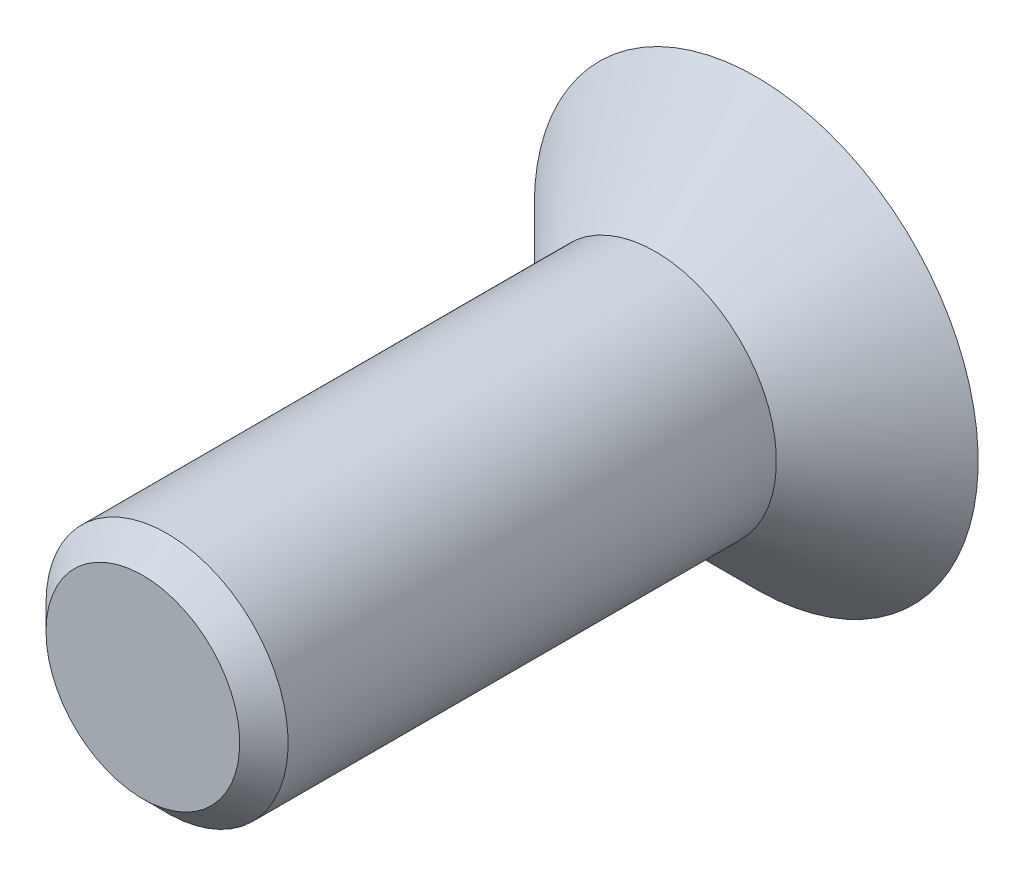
ISO-10303-21;
HEADER;
FILE_DESCRIPTION(('STEP AP214'),'2;1');
FILE_NAME('part.step','',(''),(''),'','','');
FILE_SCHEMA(('AUTOMOTIVE_DESIGN { 1 0 10303 214 1 1 1 1 }'));
ENDSEC;
DATA;
#1=APPLICATION_CONTEXT('core data for automotive mechanical design processes');
#2=APPLICATION_PROTOCOL_DEFINITION('international standard','automotive_design',2000,#1);
#3=PRODUCT_CONTEXT('',#1,'mechanical');
#4=PRODUCT('Part','Part','',(#3));
#5=PRODUCT_RELATED_PRODUCT_CATEGORY('part','',(#4));
#6=PRODUCT_DEFINITION_FORMATION('','',#4);
#7=PRODUCT_DEFINITION_CONTEXT('part definition',#1,'design');
#8=PRODUCT_DEFINITION('design','',#6,#7);
#9=PRODUCT_DEFINITION_SHAPE('','',#8);
#10=(LENGTH_UNIT() NAMED_UNIT(*) SI_UNIT(.MILLI.,.METRE.));
#11=(NAMED_UNIT(*) PLANE_ANGLE_UNIT() SI_UNIT($,.RADIAN.));
#12=(NAMED_UNIT(*) SI_UNIT($,.STERADIAN.) SOLID_ANGLE_UNIT());
#13=UNCERTAINTY_MEASURE_WITH_UNIT(LENGTH_MEASURE(1.E-05),#10,'distance_accuracy_value','');
#14=(GEOMETRIC_REPRESENTATION_CONTEXT(3) GLOBAL_UNCERTAINTY_ASSIGNED_CONTEXT((#13)) GLOBAL_UNIT_ASSIGNED_CONTEXT((#10,
#11,#12)) REPRESENTATION_CONTEXT('',''));
#15=CARTESIAN_POINT('',(0.,0.,0.));
#16=DIRECTION('',(0.,0.,1.));
#17=DIRECTION('',(1.,0.,0.));
#18=AXIS2_PLACEMENT_3D('',#15,#16,#17);
#19=CARTESIAN_POINT('',(0.,0.,-1.25));
#20=DIRECTION('',(0.,0.,1.));
#21=DIRECTION('',(0.999999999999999,0.,0.));
#22=AXIS2_PLACEMENT_3D('',#19,#20,#21);
#23=PLANE('',#22);
#24=CARTESIAN_POINT('',(0.,0.,-1.25));
#25=DIRECTION('',(0.,0.,-1.));
#26=DIRECTION('',(-0.999999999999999,0.,0.));
#27=AXIS2_PLACEMENT_3D('',#24,#25,#26);
#28=CIRCLE('',#27,2.75);
#29=CARTESIAN_POINT('',(-2.75000000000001,0.,-1.25));
#30=VERTEX_POINT('',#29);
#31=EDGE_CURVE('E85',#30,#30,#28,.T.);
#32=ORIENTED_EDGE('',*,*,#31,.T.);
#33=EDGE_LOOP('',(#32));
#34=FACE_BOUND('',#33,.T.);
#35=DIRECTION('',(-0.866025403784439,0.499999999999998,0.));
#36=VECTOR('',#35,1.);
#37=CARTESIAN_POINT('',(0.,1.15470053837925,-1.25));
#38=LINE('',#37,#36);
#39=CARTESIAN_POINT('',(1.,0.577350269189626,-1.25));
#40=VERTEX_POINT('',#39);
#41=CARTESIAN_POINT('',(0.,1.15470053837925,-1.25));
#42=VERTEX_POINT('',#41);
#43=EDGE_CURVE('E42',#40,#42,#38,.T.);
#44=ORIENTED_EDGE('',*,*,#43,.T.);
#45=DIRECTION('',(-0.866025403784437,-0.500000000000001,0.));
#46=VECTOR('',#45,1.);
#47=CARTESIAN_POINT('',(-1.,0.577350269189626,-1.25));
#48=LINE('',#47,#46);
#49=CARTESIAN_POINT('',(-1.,0.577350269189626,-1.25));
#50=VERTEX_POINT('',#49);
#51=EDGE_CURVE('E142',#42,#50,#48,.T.);
#52=ORIENTED_EDGE('',*,*,#51,.T.);
#53=DIRECTION('',(0.,-0.999999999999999,0.));
#54=VECTOR('',#53,1.);
#55=CARTESIAN_POINT('',(-1.,-0.57735026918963,-1.25));
#56=LINE('',#55,#54);
#57=CARTESIAN_POINT('',(-1.,-0.57735026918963,-1.25));
#58=VERTEX_POINT('',#57);
#59=EDGE_CURVE('E145',#50,#58,#56,.T.);
#60=ORIENTED_EDGE('',*,*,#59,.T.);
#61=DIRECTION('',(0.866025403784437,-0.500000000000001,0.));
#62=VECTOR('',#61,1.);
#63=CARTESIAN_POINT('',(-1.,-0.57735026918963,-1.25));
#64=LINE('',#63,#62);
#65=CARTESIAN_POINT('',(0.,-1.15470053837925,-1.25));
#66=VERTEX_POINT('',#65);
#67=EDGE_CURVE('E151',#58,#66,#64,.T.);
#68=ORIENTED_EDGE('',*,*,#67,.T.);
#69=DIRECTION('',(0.866025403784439,0.499999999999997,0.));
#70=VECTOR('',#69,1.);
#71=CARTESIAN_POINT('',(0.,-1.15470053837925,-1.25));
#72=LINE('',#71,#70);
#73=CARTESIAN_POINT('',(1.,-0.57735026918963,-1.25));
#74=VERTEX_POINT('',#73);
#75=EDGE_CURVE('E154',#66,#74,#72,.T.);
#76=ORIENTED_EDGE('',*,*,#75,.T.);
#77=DIRECTION('',(0.,0.999999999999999,0.));
#78=VECTOR('',#77,1.);
#79=CARTESIAN_POINT('',(1.,-0.57735026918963,-1.25));
#80=LINE('',#79,#78);
#81=EDGE_CURVE('E91',#74,#40,#80,.T.);
#82=ORIENTED_EDGE('',*,*,#81,.T.);
#83=EDGE_LOOP('',(#44,#52,#60,#68,#76,#82));
#84=FACE_BOUND('',#83,.T.);
#85=ADVANCED_FACE('F28',(#34,#84),#23,.F.);
#86=CARTESIAN_POINT('',(0.,0.,0.));
#87=DIRECTION('',(0.,0.,-1.));
#88=DIRECTION('',(-0.999999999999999,0.,0.));
#89=AXIS2_PLACEMENT_3D('',#86,#87,#88);
#90=CONICAL_SURFACE('',#89,1.5,0.78539816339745);
#91=CARTESIAN_POINT('',(0.,0.,0.));
#92=DIRECTION('',(0.,0.,1.));
#93=DIRECTION('',(0.999999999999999,0.,0.));
#94=AXIS2_PLACEMENT_3D('',#91,#92,#93);
#95=CIRCLE('',#94,1.5);
#96=CARTESIAN_POINT('',(-1.5,0.,0.));
#97=VERTEX_POINT('',#96);
#98=EDGE_CURVE('E143',#97,#97,#95,.T.);
#99=CARTESIAN_POINT('',(-2.75000000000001,0.,-1.25));
#100=CARTESIAN_POINT('',(-2.73697916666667,0.,-1.23697916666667));
#101=CARTESIAN_POINT('',(-2.72395833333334,0.,-1.22395833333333));
#102=CARTESIAN_POINT('',(-2.69791666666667,0.,-1.19791666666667));
#103=CARTESIAN_POINT('',(-2.68489583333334,0.,-1.18489583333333));
#104=CARTESIAN_POINT('',(-2.65885416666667,0.,-1.15885416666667));
#105=CARTESIAN_POINT('',(-2.64583333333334,0.,-1.14583333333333));
#106=CARTESIAN_POINT('',(-2.61979166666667,0.,-1.11979166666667));
#107=CARTESIAN_POINT('',(-2.60677083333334,0.,-1.10677083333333));
#108=CARTESIAN_POINT('',(-2.58072916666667,0.,-1.08072916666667));
#109=CARTESIAN_POINT('',(-2.56770833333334,0.,-1.06770833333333));
#110=CARTESIAN_POINT('',(-2.54166666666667,0.,-1.04166666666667));
#111=CARTESIAN_POINT('',(-2.52864583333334,0.,-1.02864583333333));
#112=CARTESIAN_POINT('',(-2.50260416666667,0.,-1.00260416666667));
#113=CARTESIAN_POINT('',(-2.48958333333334,0.,-0.989583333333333));
#114=CARTESIAN_POINT('',(-2.46354166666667,0.,-0.963541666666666));
#115=CARTESIAN_POINT('',(-2.45052083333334,0.,-0.950520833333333));
#116=CARTESIAN_POINT('',(-2.42447916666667,0.,-0.924479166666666));
#117=CARTESIAN_POINT('',(-2.41145833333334,0.,-0.911458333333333));
#118=CARTESIAN_POINT('',(-2.38541666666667,0.,-0.885416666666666));
#119=CARTESIAN_POINT('',(-2.37239583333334,0.,-0.872395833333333));
#120=CARTESIAN_POINT('',(-2.34635416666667,0.,-0.846354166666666));
#121=CARTESIAN_POINT('',(-2.33333333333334,0.,-0.833333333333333));
#122=CARTESIAN_POINT('',(-2.30729166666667,0.,-0.807291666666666));
#123=CARTESIAN_POINT('',(-2.29427083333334,0.,-0.794270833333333));
#124=CARTESIAN_POINT('',(-2.26822916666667,0.,-0.768229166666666));
#125=CARTESIAN_POINT('',(-2.25520833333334,0.,-0.755208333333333));
#126=CARTESIAN_POINT('',(-2.22916666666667,0.,-0.729166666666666));
#127=CARTESIAN_POINT('',(-2.21614583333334,0.,-0.716145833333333));
#128=CARTESIAN_POINT('',(-2.19010416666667,0.,-0.690104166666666));
#129=CARTESIAN_POINT('',(-2.17708333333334,0.,-0.677083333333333));
#130=CARTESIAN_POINT('',(-2.15104166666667,0.,-0.651041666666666));
#131=CARTESIAN_POINT('',(-2.13802083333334,0.,-0.638020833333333));
#132=CARTESIAN_POINT('',(-2.11197916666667,0.,-0.611979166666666));
#133=CARTESIAN_POINT('',(-2.09895833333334,0.,-0.598958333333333));
#134=CARTESIAN_POINT('',(-2.07291666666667,0.,-0.572916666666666));
#135=CARTESIAN_POINT('',(-2.05989583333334,0.,-0.559895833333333));
#136=CARTESIAN_POINT('',(-2.03385416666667,0.,-0.533854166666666));
#137=CARTESIAN_POINT('',(-2.02083333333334,0.,-0.520833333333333));
#138=CARTESIAN_POINT('',(-1.99479166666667,0.,-0.494791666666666));
#139=CARTESIAN_POINT('',(-1.98177083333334,0.,-0.481770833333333));
#140=CARTESIAN_POINT('',(-1.95572916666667,0.,-0.455729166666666));
#141=CARTESIAN_POINT('',(-1.94270833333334,0.,-0.442708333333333));
#142=CARTESIAN_POINT('',(-1.91666666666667,0.,-0.416666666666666));
#143=CARTESIAN_POINT('',(-1.90364583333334,0.,-0.403645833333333));
#144=CARTESIAN_POINT('',(-1.87760416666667,0.,-0.377604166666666));
#145=CARTESIAN_POINT('',(-1.86458333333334,0.,-0.364583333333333));
#146=CARTESIAN_POINT('',(-1.83854166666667,0.,-0.338541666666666));
#147=CARTESIAN_POINT('',(-1.82552083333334,0.,-0.325520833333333));
#148=CARTESIAN_POINT('',(-1.79947916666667,0.,-0.299479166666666));
#149=CARTESIAN_POINT('',(-1.78645833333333,0.,-0.286458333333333));
#150=CARTESIAN_POINT('',(-1.76041666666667,0.,-0.260416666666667));
#151=CARTESIAN_POINT('',(-1.74739583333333,0.,-0.247395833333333));
#152=CARTESIAN_POINT('',(-1.72135416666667,0.,-0.221354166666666));
#153=CARTESIAN_POINT('',(-1.70833333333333,0.,-0.208333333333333));
#154=CARTESIAN_POINT('',(-1.68229166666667,0.,-0.182291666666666));
#155=CARTESIAN_POINT('',(-1.66927083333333,0.,-0.169270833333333));
#156=CARTESIAN_POINT('',(-1.64322916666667,0.,-0.143229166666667));
#157=CARTESIAN_POINT('',(-1.63020833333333,0.,-0.130208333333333));
#158=CARTESIAN_POINT('',(-1.60416666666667,0.,-0.104166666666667));
#159=CARTESIAN_POINT('',(-1.59114583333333,0.,-0.0911458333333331));
#160=CARTESIAN_POINT('',(-1.56510416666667,0.,-0.0651041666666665));
#161=CARTESIAN_POINT('',(-1.55208333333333,0.,-0.0520833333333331));
#162=CARTESIAN_POINT('',(-1.52604166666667,0.,-0.0260416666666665));
#163=CARTESIAN_POINT('',(-1.51302083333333,0.,-0.0130208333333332));
#164=CARTESIAN_POINT('',(-1.5,0.,0.));
#165=B_SPLINE_CURVE_WITH_KNOTS('',3,(#99,#100,#101,#102,#103,#104,#105,#106,#107,#108,#109,#110,
#111,#112,#113,#114,#115,#116,#117,#118,#119,#120,#121,#122,#123,#124,#125,#126,#127,#128,#129,
#130,#131,#132,#133,#134,#135,#136,#137,#138,#139,#140,#141,#142,#143,#144,#145,#146,#147,#148,
#149,#150,#151,#152,#153,#154,#155,#156,#157,#158,#159,#160,#161,#162,#163,#164),.UNSPECIFIED.,
.F.,.F.,(4,2,2,2,2,2,2,2,2,2,2,2,2,2,2,2,2,2,2,2,2,2,2,2,2,2,2,2,2,2,2,2,4),(0.,
0.0552427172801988,0.110485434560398,0.165728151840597,0.220970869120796,0.276213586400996,
0.331456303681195,0.386699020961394,0.441941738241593,0.497184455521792,0.552427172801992,
0.607669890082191,0.66291260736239,0.718155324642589,0.773398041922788,0.828640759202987,
0.883883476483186,0.939126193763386,0.994368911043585,1.04961162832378,1.10485434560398,
1.16009706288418,1.21533978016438,1.27058249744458,1.32582521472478,1.38106793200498,
1.43631064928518,1.49155336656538,1.54679608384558,1.60203880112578,1.65728151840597,
1.71252423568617,1.76776695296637),.UNSPECIFIED.);
#166=EDGE_CURVE('BSEAM129',#30,#97,#165,.T.);
#167=ORIENTED_EDGE('',*,*,#31,.F.);
#168=ORIENTED_EDGE('',*,*,#98,.F.);
#169=ORIENTED_EDGE('',*,*,#166,.T.);
#170=ORIENTED_EDGE('',*,*,#166,.F.);
#171=EDGE_LOOP('',(#167,#169,#168,#170));
#172=FACE_BOUND('',#171,.T.);
#173=ADVANCED_FACE('F129',(#172),#90,.T.);
#174=CARTESIAN_POINT('',(0.,1.15470053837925,0.0499999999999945));
#175=DIRECTION('',(-0.499999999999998,-0.866025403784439,0.));
#176=DIRECTION('',(0.866025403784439,-0.499999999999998,0.));
#177=AXIS2_PLACEMENT_3D('',#174,#175,#176);
#178=PLANE('',#177);
#179=DIRECTION('',(-0.866025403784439,0.499999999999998,0.));
#180=VECTOR('',#179,1.);
#181=CARTESIAN_POINT('',(0.5,0.866025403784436,0.));
#182=LINE('',#181,#180);
#183=CARTESIAN_POINT('',(1.,0.577350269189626,0.));
#184=VERTEX_POINT('',#183);
#185=CARTESIAN_POINT('',(0.,1.15470053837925,0.));
#186=VERTEX_POINT('',#185);
#187=EDGE_CURVE('E50',#184,#186,#182,.T.);
#188=ORIENTED_EDGE('',*,*,#187,.T.);
#189=DIRECTION('',(0.,0.,-1.));
#190=VECTOR('',#189,1.);
#191=CARTESIAN_POINT('',(0.,1.15470053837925,0.0499999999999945));
#192=LINE('',#191,#190);
#193=EDGE_CURVE('E163',#186,#42,#192,.T.);
#194=ORIENTED_EDGE('',*,*,#193,.T.);
#195=ORIENTED_EDGE('',*,*,#43,.F.);
#196=DIRECTION('',(0.,0.,-1.));
#197=VECTOR('',#196,1.);
#198=CARTESIAN_POINT('',(1.,0.577350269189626,0.0499999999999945));
#199=LINE('',#198,#197);
#200=EDGE_CURVE('E96',#184,#40,#199,.T.);
#201=ORIENTED_EDGE('',*,*,#200,.F.);
#202=EDGE_LOOP('',(#188,#194,#195,#201));
#203=FACE_BOUND('',#202,.T.);
#204=ADVANCED_FACE('F134',(#203),#178,.T.);
#205=CARTESIAN_POINT('',(-1.,0.577350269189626,0.0499999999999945));
#206=DIRECTION('',(0.500000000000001,-0.866025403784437,0.));
#207=DIRECTION('',(0.866025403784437,0.500000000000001,0.));
#208=AXIS2_PLACEMENT_3D('',#205,#206,#207);
#209=PLANE('',#208);
#210=DIRECTION('',(-0.866025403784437,-0.500000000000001,0.));
#211=VECTOR('',#210,1.);
#212=CARTESIAN_POINT('',(-0.5,0.866025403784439,0.));
#213=LINE('',#212,#211);
#214=CARTESIAN_POINT('',(-1.,0.577350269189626,0.));
#215=VERTEX_POINT('',#214);
#216=EDGE_CURVE('E108',#186,#215,#213,.T.);
#217=ORIENTED_EDGE('',*,*,#216,.T.);
#218=DIRECTION('',(0.,0.,-1.));
#219=VECTOR('',#218,1.);
#220=CARTESIAN_POINT('',(-1.,0.577350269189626,0.0499999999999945));
#221=LINE('',#220,#219);
#222=EDGE_CURVE('E161',#215,#50,#221,.T.);
#223=ORIENTED_EDGE('',*,*,#222,.T.);
#224=ORIENTED_EDGE('',*,*,#51,.F.);
#225=ORIENTED_EDGE('',*,*,#193,.F.);
#226=EDGE_LOOP('',(#217,#223,#224,#225));
#227=FACE_BOUND('',#226,.T.);
#228=ADVANCED_FACE('F166',(#227),#209,.T.);
#229=CARTESIAN_POINT('',(-1.,-0.57735026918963,0.0499999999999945));
#230=DIRECTION('',(0.999999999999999,0.,0.));
#231=DIRECTION('',(0.,0.,-1.));
#232=AXIS2_PLACEMENT_3D('',#229,#230,#231);
#233=PLANE('',#232);
#234=DIRECTION('',(0.,-0.999999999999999,0.));
#235=VECTOR('',#234,1.);
#236=CARTESIAN_POINT('',(-1.,0.,0.));
#237=LINE('',#236,#235);
#238=CARTESIAN_POINT('',(-1.,-0.57735026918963,0.));
#239=VERTEX_POINT('',#238);
#240=EDGE_CURVE('E102',#215,#239,#237,.T.);
#241=ORIENTED_EDGE('',*,*,#240,.T.);
#242=DIRECTION('',(0.,0.,-1.));
#243=VECTOR('',#242,1.);
#244=CARTESIAN_POINT('',(-1.,-0.57735026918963,0.0499999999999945));
#245=LINE('',#244,#243);
#246=EDGE_CURVE('E159',#239,#58,#245,.T.);
#247=ORIENTED_EDGE('',*,*,#246,.T.);
#248=ORIENTED_EDGE('',*,*,#59,.F.);
#249=ORIENTED_EDGE('',*,*,#222,.F.);
#250=EDGE_LOOP('',(#241,#247,#248,#249));
#251=FACE_BOUND('',#250,.T.);
#252=ADVANCED_FACE('F170',(#251),#233,.T.);
#253=CARTESIAN_POINT('',(-1.,-0.57735026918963,0.0499999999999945));
#254=DIRECTION('',(0.500000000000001,0.866025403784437,0.));
#255=DIRECTION('',(-0.866025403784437,0.500000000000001,0.));
#256=AXIS2_PLACEMENT_3D('',#253,#254,#255);
#257=PLANE('',#256);
#258=DIRECTION('',(0.866025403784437,-0.500000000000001,0.));
#259=VECTOR('',#258,1.);
#260=CARTESIAN_POINT('',(-0.500000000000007,-0.866025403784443,0.));
#261=LINE('',#260,#259);
#262=CARTESIAN_POINT('',(0.,-1.15470053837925,0.));
#263=VERTEX_POINT('',#262);
#264=EDGE_CURVE('E100',#239,#263,#261,.T.);
#265=ORIENTED_EDGE('',*,*,#264,.T.);
#266=DIRECTION('',(0.,0.,-1.));
#267=VECTOR('',#266,1.);
#268=CARTESIAN_POINT('',(0.,-1.15470053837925,0.0499999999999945));
#269=LINE('',#268,#267);
#270=EDGE_CURVE('E95',#263,#66,#269,.T.);
#271=ORIENTED_EDGE('',*,*,#270,.T.);
#272=ORIENTED_EDGE('',*,*,#67,.F.);
#273=ORIENTED_EDGE('',*,*,#246,.F.);
#274=EDGE_LOOP('',(#265,#271,#272,#273));
#275=FACE_BOUND('',#274,.T.);
#276=ADVANCED_FACE('F174',(#275),#257,.T.);
#277=CARTESIAN_POINT('',(0.,-1.15470053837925,0.0499999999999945));
#278=DIRECTION('',(-0.499999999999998,0.86602540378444,0.));
#279=DIRECTION('',(-0.86602540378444,-0.499999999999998,0.));
#280=AXIS2_PLACEMENT_3D('',#277,#278,#279);
#281=PLANE('',#280);
#282=DIRECTION('',(0.86602540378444,0.499999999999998,0.));
#283=VECTOR('',#282,1.);
#284=CARTESIAN_POINT('',(0.5,-0.866025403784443,0.));
#285=LINE('',#284,#283);
#286=CARTESIAN_POINT('',(1.,-0.57735026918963,0.));
#287=VERTEX_POINT('',#286);
#288=EDGE_CURVE('E82',#263,#287,#285,.T.);
#289=ORIENTED_EDGE('',*,*,#288,.T.);
#290=DIRECTION('',(0.,0.,-1.));
#291=VECTOR('',#290,1.);
#292=CARTESIAN_POINT('',(1.,-0.57735026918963,0.0499999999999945));
#293=LINE('',#292,#291);
#294=EDGE_CURVE('E88',#287,#74,#293,.T.);
#295=ORIENTED_EDGE('',*,*,#294,.T.);
#296=ORIENTED_EDGE('',*,*,#75,.F.);
#297=ORIENTED_EDGE('',*,*,#270,.F.);
#298=EDGE_LOOP('',(#289,#295,#296,#297));
#299=FACE_BOUND('',#298,.T.);
#300=ADVANCED_FACE('F99',(#299),#281,.T.);
#301=CARTESIAN_POINT('',(1.,-0.57735026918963,0.0499999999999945));
#302=DIRECTION('',(-0.999999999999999,0.,0.));
#303=DIRECTION('',(0.,0.,1.));
#304=AXIS2_PLACEMENT_3D('',#301,#302,#303);
#305=PLANE('',#304);
#306=DIRECTION('',(0.,0.999999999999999,0.));
#307=VECTOR('',#306,1.);
#308=CARTESIAN_POINT('',(1.,0.,0.));
#309=LINE('',#308,#307);
#310=EDGE_CURVE('E78',#287,#184,#309,.T.);
#311=ORIENTED_EDGE('',*,*,#310,.T.);
#312=ORIENTED_EDGE('',*,*,#200,.T.);
#313=ORIENTED_EDGE('',*,*,#81,.F.);
#314=ORIENTED_EDGE('',*,*,#294,.F.);
#315=EDGE_LOOP('',(#311,#312,#313,#314));
#316=FACE_BOUND('',#315,.T.);
#317=ADVANCED_FACE('F89',(#316),#305,.T.);
#318=CARTESIAN_POINT('',(0.,0.,0.));
#319=DIRECTION('',(0.,0.,-1.));
#320=DIRECTION('',(-0.999999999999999,0.,0.));
#321=AXIS2_PLACEMENT_3D('',#318,#319,#320);
#322=PLANE('',#321);
#323=ORIENTED_EDGE('',*,*,#216,.F.);
#324=ORIENTED_EDGE('',*,*,#187,.F.);
#325=ORIENTED_EDGE('',*,*,#310,.F.);
#326=ORIENTED_EDGE('',*,*,#288,.F.);
#327=ORIENTED_EDGE('',*,*,#264,.F.);
#328=ORIENTED_EDGE('',*,*,#240,.F.);
#329=EDGE_LOOP('',(#323,#324,#325,#326,#327,#328));
#330=FACE_BOUND('',#329,.T.);
#331=ADVANCED_FACE('F80',(#330),#322,.T.);
#332=CARTESIAN_POINT('',(0.,0.,6.34999999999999));
#333=DIRECTION('',(0.,0.,1.));
#334=DIRECTION('',(0.999999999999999,0.,0.));
#335=AXIS2_PLACEMENT_3D('',#332,#333,#334);
#336=PLANE('',#335);
#337=CARTESIAN_POINT('',(0.,0.,6.34999999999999));
#338=DIRECTION('',(0.,0.,1.));
#339=DIRECTION('',(0.999999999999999,0.,0.));
#340=AXIS2_PLACEMENT_3D('',#337,#338,#339);
#341=CIRCLE('',#340,1.2);
#342=CARTESIAN_POINT('',(-1.2,0.,6.34999999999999));
#343=VERTEX_POINT('',#342);
#344=EDGE_CURVE('E35',#343,#343,#341,.T.);
#345=ORIENTED_EDGE('',*,*,#344,.T.);
#346=EDGE_LOOP('',(#345));
#347=FACE_BOUND('',#346,.T.);
#348=ADVANCED_FACE('F114',(#347),#336,.T.);
#349=CARTESIAN_POINT('',(0.,0.,0.));
#350=DIRECTION('',(0.,0.,1.));
#351=DIRECTION('',(0.999999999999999,0.,0.));
#352=AXIS2_PLACEMENT_3D('',#349,#350,#351);
#353=CYLINDRICAL_SURFACE('',#352,1.5);
#354=CARTESIAN_POINT('',(0.,0.,6.05));
#355=DIRECTION('',(0.,0.,1.));
#356=DIRECTION('',(0.999999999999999,0.,0.));
#357=AXIS2_PLACEMENT_3D('',#354,#355,#356);
#358=CIRCLE('',#357,1.5);
#359=CARTESIAN_POINT('',(-1.49999999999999,0.,6.05));
#360=VERTEX_POINT('',#359);
#361=EDGE_CURVE('E11',#360,#360,#358,.F.);
#362=ORIENTED_EDGE('',*,*,#361,.T.);
#363=EDGE_LOOP('',(#362));
#364=FACE_BOUND('',#363,.T.);
#365=ORIENTED_EDGE('',*,*,#98,.T.);
#366=EDGE_LOOP('',(#365));
#367=FACE_BOUND('',#366,.T.);
#368=ADVANCED_FACE('F118',(#364,#367),#353,.T.);
#369=CARTESIAN_POINT('',(0.,0.,6.34999999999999));
#370=DIRECTION('',(0.,0.,-1.));
#371=DIRECTION('',(-0.999999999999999,0.,0.));
#372=AXIS2_PLACEMENT_3D('',#369,#370,#371);
#373=CONICAL_SURFACE('',#372,1.2,0.785398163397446);
#374=CARTESIAN_POINT('',(-1.49999999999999,0.,6.05));
#375=CARTESIAN_POINT('',(-1.49687499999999,0.,6.053125));
#376=CARTESIAN_POINT('',(-1.49374999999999,0.,6.05625));
#377=CARTESIAN_POINT('',(-1.48749999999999,0.,6.0625));
#378=CARTESIAN_POINT('',(-1.48437499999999,0.,6.065625));
#379=CARTESIAN_POINT('',(-1.47812499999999,0.,6.071875));
#380=CARTESIAN_POINT('',(-1.47499999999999,0.,6.075));
#381=CARTESIAN_POINT('',(-1.46874999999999,0.,6.08125));
#382=CARTESIAN_POINT('',(-1.46562499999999,0.,6.084375));
#383=CARTESIAN_POINT('',(-1.45937499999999,0.,6.090625));
#384=CARTESIAN_POINT('',(-1.45624999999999,0.,6.09375));
#385=CARTESIAN_POINT('',(-1.44999999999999,0.,6.1));
#386=CARTESIAN_POINT('',(-1.44687499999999,0.,6.103125));
#387=CARTESIAN_POINT('',(-1.44062499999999,0.,6.109375));
#388=CARTESIAN_POINT('',(-1.43749999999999,0.,6.1125));
#389=CARTESIAN_POINT('',(-1.43124999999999,0.,6.11875));
#390=CARTESIAN_POINT('',(-1.42812499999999,0.,6.121875));
#391=CARTESIAN_POINT('',(-1.42187499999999,0.,6.128125));
#392=CARTESIAN_POINT('',(-1.41874999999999,0.,6.13125));
#393=CARTESIAN_POINT('',(-1.41249999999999,0.,6.1375));
#394=CARTESIAN_POINT('',(-1.40937499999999,0.,6.140625));
#395=CARTESIAN_POINT('',(-1.40312499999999,0.,6.146875));
#396=CARTESIAN_POINT('',(-1.4,0.,6.15));
#397=CARTESIAN_POINT('',(-1.39374999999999,0.,6.15625));
#398=CARTESIAN_POINT('',(-1.39062499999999,0.,6.159375));
#399=CARTESIAN_POINT('',(-1.384375,0.,6.165625));
#400=CARTESIAN_POINT('',(-1.38125,0.,6.16875));
#401=CARTESIAN_POINT('',(-1.375,0.,6.175));
#402=CARTESIAN_POINT('',(-1.371875,0.,6.178125));
#403=CARTESIAN_POINT('',(-1.365625,0.,6.184375));
#404=CARTESIAN_POINT('',(-1.3625,0.,6.1875));
#405=CARTESIAN_POINT('',(-1.35625,0.,6.19375));
#406=CARTESIAN_POINT('',(-1.353125,0.,6.196875));
#407=CARTESIAN_POINT('',(-1.346875,0.,6.203125));
#408=CARTESIAN_POINT('',(-1.34375,0.,6.20625));
#409=CARTESIAN_POINT('',(-1.3375,0.,6.2125));
#410=CARTESIAN_POINT('',(-1.334375,0.,6.215625));
#411=CARTESIAN_POINT('',(-1.328125,0.,6.221875));
#412=CARTESIAN_POINT('',(-1.325,0.,6.225));
#413=CARTESIAN_POINT('',(-1.31875,0.,6.23125));
#414=CARTESIAN_POINT('',(-1.315625,0.,6.234375));
#415=CARTESIAN_POINT('',(-1.309375,0.,6.240625));
#416=CARTESIAN_POINT('',(-1.30625,0.,6.24375));
#417=CARTESIAN_POINT('',(-1.3,0.,6.25));
#418=CARTESIAN_POINT('',(-1.296875,0.,6.253125));
#419=CARTESIAN_POINT('',(-1.290625,0.,6.259375));
#420=CARTESIAN_POINT('',(-1.2875,0.,6.2625));
#421=CARTESIAN_POINT('',(-1.28125,0.,6.26875));
#422=CARTESIAN_POINT('',(-1.278125,0.,6.271875));
#423=CARTESIAN_POINT('',(-1.271875,0.,6.278125));
#424=CARTESIAN_POINT('',(-1.26875,0.,6.28125));
#425=CARTESIAN_POINT('',(-1.2625,0.,6.2875));
#426=CARTESIAN_POINT('',(-1.259375,0.,6.290625));
#427=CARTESIAN_POINT('',(-1.253125,0.,6.296875));
#428=CARTESIAN_POINT('',(-1.25,0.,6.3));
#429=CARTESIAN_POINT('',(-1.24375,0.,6.30625));
#430=CARTESIAN_POINT('',(-1.240625,0.,6.309375));
#431=CARTESIAN_POINT('',(-1.234375,0.,6.315625));
#432=CARTESIAN_POINT('',(-1.23125,0.,6.31875));
#433=CARTESIAN_POINT('',(-1.225,0.,6.325));
#434=CARTESIAN_POINT('',(-1.221875,0.,6.328125));
#435=CARTESIAN_POINT('',(-1.215625,0.,6.334375));
#436=CARTESIAN_POINT('',(-1.2125,0.,6.3375));
#437=CARTESIAN_POINT('',(-1.20625,0.,6.34375));
#438=CARTESIAN_POINT('',(-1.203125,0.,6.34687499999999));
#439=CARTESIAN_POINT('',(-1.2,0.,6.34999999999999));
#440=B_SPLINE_CURVE_WITH_KNOTS('',3,(#374,#375,#376,#377,#378,#379,#380,#381,#382,#383,#384,
#385,#386,#387,#388,#389,#390,#391,#392,#393,#394,#395,#396,#397,#398,#399,#400,#401,#402,#403,
#404,#405,#406,#407,#408,#409,#410,#411,#412,#413,#414,#415,#416,#417,#418,#419,#420,#421,#422,
#423,#424,#425,#426,#427,#428,#429,#430,#431,#432,#433,#434,#435,#436,#437,#438,#439),
.UNSPECIFIED.,.F.,.F.,(4,2,2,2,2,2,2,2,2,2,2,2,2,2,2,2,2,2,2,2,2,2,2,2,2,2,2,2,2,2,2,2,4),(0.,
0.013258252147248,0.0265165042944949,0.0397747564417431,0.05303300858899,0.0662912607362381,
0.079549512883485,0.092807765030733,0.10606601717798,0.119324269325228,0.132582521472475,
0.145840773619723,0.15909902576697,0.172357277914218,0.185615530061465,0.198873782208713,
0.21213203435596,0.225390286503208,0.238648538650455,0.251906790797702,0.26516504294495,
0.278423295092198,0.291681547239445,0.304939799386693,0.31819805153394,0.331456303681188,
0.344714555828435,0.357972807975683,0.371231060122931,0.384489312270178,0.397747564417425,
0.411005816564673,0.42426406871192),.UNSPECIFIED.);
#441=EDGE_CURVE('BSEAM116',#360,#343,#440,.T.);
#442=ORIENTED_EDGE('',*,*,#361,.F.);
#443=ORIENTED_EDGE('',*,*,#344,.F.);
#444=ORIENTED_EDGE('',*,*,#441,.T.);
#445=ORIENTED_EDGE('',*,*,#441,.F.);
#446=EDGE_LOOP('',(#442,#444,#443,#445));
#447=FACE_BOUND('',#446,.T.);
#448=ADVANCED_FACE('F116',(#447),#373,.T.);
#449=CLOSED_SHELL('',(#85,#173,#204,#228,#252,#276,#300,#317,#331,#348,#368,#448));
#450=MANIFOLD_SOLID_BREP('B2',#449);
#451=ADVANCED_BREP_SHAPE_REPRESENTATION('',(#18,#450),#14);
#452=SHAPE_DEFINITION_REPRESENTATION(#9,#451);
ENDSEC;
END-ISO-10303-21;
